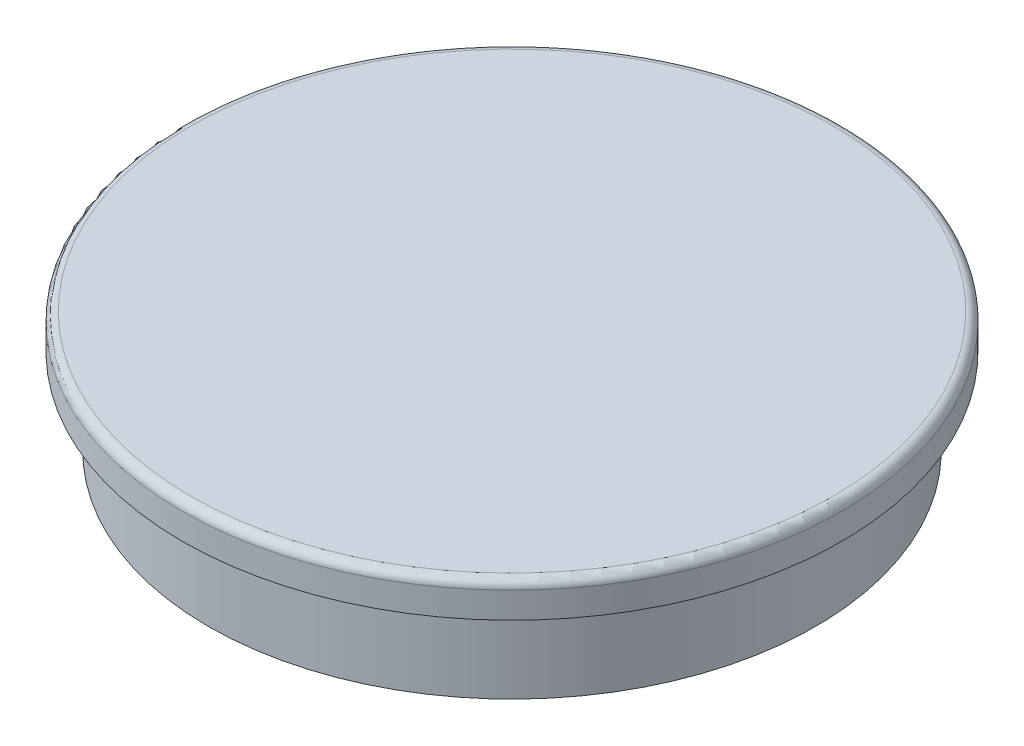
ISO-10303-21;
HEADER;
FILE_DESCRIPTION(('STEP AP214'),'2;1');
FILE_NAME('part.step','',(''),(''),'','','');
FILE_SCHEMA(('AUTOMOTIVE_DESIGN { 1 0 10303 214 1 1 1 1 }'));
ENDSEC;
DATA;
#1=APPLICATION_CONTEXT('core data for automotive mechanical design processes');
#2=APPLICATION_PROTOCOL_DEFINITION('international standard','automotive_design',2000,#1);
#3=PRODUCT_CONTEXT('',#1,'mechanical');
#4=PRODUCT('Part','Part','',(#3));
#5=PRODUCT_RELATED_PRODUCT_CATEGORY('part','',(#4));
#6=PRODUCT_DEFINITION_FORMATION('','',#4);
#7=PRODUCT_DEFINITION_CONTEXT('part definition',#1,'design');
#8=PRODUCT_DEFINITION('design','',#6,#7);
#9=PRODUCT_DEFINITION_SHAPE('','',#8);
#10=(LENGTH_UNIT() NAMED_UNIT(*) SI_UNIT(.MILLI.,.METRE.));
#11=(NAMED_UNIT(*) PLANE_ANGLE_UNIT() SI_UNIT($,.RADIAN.));
#12=(NAMED_UNIT(*) SI_UNIT($,.STERADIAN.) SOLID_ANGLE_UNIT());
#13=UNCERTAINTY_MEASURE_WITH_UNIT(LENGTH_MEASURE(1.E-05),#10,'distance_accuracy_value','');
#14=(GEOMETRIC_REPRESENTATION_CONTEXT(3) GLOBAL_UNCERTAINTY_ASSIGNED_CONTEXT((#13)) GLOBAL_UNIT_ASSIGNED_CONTEXT((#10,
#11,#12)) REPRESENTATION_CONTEXT('',''));
#15=CARTESIAN_POINT('',(0.,0.,0.));
#16=DIRECTION('',(0.,0.,1.));
#17=DIRECTION('',(1.,0.,0.));
#18=AXIS2_PLACEMENT_3D('',#15,#16,#17);
#19=CARTESIAN_POINT('',(0.,5.,0.));
#20=DIRECTION('',(0.,-1.,0.));
#21=DIRECTION('',(0.,0.,-1.));
#22=AXIS2_PLACEMENT_3D('',#19,#20,#21);
#23=CYLINDRICAL_SURFACE('',#22,17.5);
#24=CARTESIAN_POINT('',(0.,5.,0.));
#25=DIRECTION('',(0.,1.,0.));
#26=DIRECTION('',(0.,0.,1.));
#27=AXIS2_PLACEMENT_3D('',#24,#25,#26);
#28=CIRCLE('',#27,17.5);
#29=CARTESIAN_POINT('',(0.,5.,17.5));
#30=VERTEX_POINT('',#29);
#31=EDGE_CURVE('E44',#30,#30,#28,.T.);
#32=ORIENTED_EDGE('',*,*,#31,.F.);
#33=EDGE_LOOP('',(#32));
#34=FACE_BOUND('',#33,.T.);
#35=CARTESIAN_POINT('',(0.,0.,0.));
#36=DIRECTION('',(0.,1.,0.));
#37=DIRECTION('',(0.,0.,1.));
#38=AXIS2_PLACEMENT_3D('',#35,#36,#37);
#39=CIRCLE('',#38,17.5);
#40=CARTESIAN_POINT('',(0.,0.,17.5));
#41=VERTEX_POINT('',#40);
#42=EDGE_CURVE('E48',#41,#41,#39,.T.);
#43=ORIENTED_EDGE('',*,*,#42,.T.);
#44=EDGE_LOOP('',(#43));
#45=FACE_BOUND('',#44,.T.);
#46=ADVANCED_FACE('F33',(#34,#45),#23,.T.);
#47=CARTESIAN_POINT('',(0.,0.,0.));
#48=DIRECTION('',(0.,1.,0.));
#49=DIRECTION('',(0.,0.,1.));
#50=AXIS2_PLACEMENT_3D('',#47,#48,#49);
#51=PLANE('',#50);
#52=ORIENTED_EDGE('',*,*,#42,.F.);
#53=EDGE_LOOP('',(#52));
#54=FACE_BOUND('',#53,.T.);
#55=ADVANCED_FACE('F72',(#54),#51,.F.);
#56=CARTESIAN_POINT('',(0.,7.,0.));
#57=DIRECTION('',(0.,-1.,0.));
#58=DIRECTION('',(0.,0.,-1.));
#59=AXIS2_PLACEMENT_3D('',#56,#57,#58);
#60=CYLINDRICAL_SURFACE('',#59,19.);
#61=CARTESIAN_POINT('',(0.,6.5,0.));
#62=DIRECTION('',(0.,1.,0.));
#63=DIRECTION('',(0.,0.,1.));
#64=AXIS2_PLACEMENT_3D('',#61,#62,#63);
#65=CIRCLE('',#64,19.);
#66=CARTESIAN_POINT('',(0.,6.5,19.));
#67=VERTEX_POINT('',#66);
#68=EDGE_CURVE('E10',#67,#67,#65,.F.);
#69=ORIENTED_EDGE('',*,*,#68,.T.);
#70=EDGE_LOOP('',(#69));
#71=FACE_BOUND('',#70,.T.);
#72=CARTESIAN_POINT('',(0.,5.,0.));
#73=DIRECTION('',(0.,1.,0.));
#74=DIRECTION('',(0.,0.,1.));
#75=AXIS2_PLACEMENT_3D('',#72,#73,#74);
#76=CIRCLE('',#75,19.);
#77=CARTESIAN_POINT('',(0.,5.,19.));
#78=VERTEX_POINT('',#77);
#79=EDGE_CURVE('E52',#78,#78,#76,.T.);
#80=ORIENTED_EDGE('',*,*,#79,.T.);
#81=EDGE_LOOP('',(#80));
#82=FACE_BOUND('',#81,.T.);
#83=ADVANCED_FACE('F57',(#71,#82),#60,.T.);
#84=CARTESIAN_POINT('',(0.,7.,0.));
#85=DIRECTION('',(0.,1.,0.));
#86=DIRECTION('',(0.,0.,1.));
#87=AXIS2_PLACEMENT_3D('',#84,#85,#86);
#88=PLANE('',#87);
#89=CARTESIAN_POINT('',(0.,7.,0.));
#90=DIRECTION('',(0.,1.,0.));
#91=DIRECTION('',(0.,0.,1.));
#92=AXIS2_PLACEMENT_3D('',#89,#90,#91);
#93=CIRCLE('',#92,18.5);
#94=CARTESIAN_POINT('',(0.,7.,18.5));
#95=VERTEX_POINT('',#94);
#96=EDGE_CURVE('E40',#95,#95,#93,.T.);
#97=ORIENTED_EDGE('',*,*,#96,.T.);
#98=EDGE_LOOP('',(#97));
#99=FACE_BOUND('',#98,.T.);
#100=ADVANCED_FACE('F61',(#99),#88,.T.);
#101=CARTESIAN_POINT('',(0.,5.,0.));
#102=DIRECTION('',(0.,1.,0.));
#103=DIRECTION('',(0.,0.,1.));
#104=AXIS2_PLACEMENT_3D('',#101,#102,#103);
#105=PLANE('',#104);
#106=ORIENTED_EDGE('',*,*,#31,.T.);
#107=EDGE_LOOP('',(#106));
#108=FACE_BOUND('',#107,.T.);
#109=ORIENTED_EDGE('',*,*,#79,.F.);
#110=EDGE_LOOP('',(#109));
#111=FACE_BOUND('',#110,.T.);
#112=ADVANCED_FACE('F59',(#108,#111),#105,.F.);
#113=CARTESIAN_POINT('',(0.,6.5,0.));
#114=DIRECTION('',(0.,1.,0.));
#115=DIRECTION('',(0.,0.,1.));
#116=AXIS2_PLACEMENT_3D('',#113,#114,#115);
#117=TOROIDAL_SURFACE('',#116,18.5,0.5);
#118=ORIENTED_EDGE('',*,*,#68,.F.);
#119=EDGE_LOOP('',(#118));
#120=FACE_BOUND('',#119,.T.);
#121=ORIENTED_EDGE('',*,*,#96,.F.);
#122=EDGE_LOOP('',(#121));
#123=FACE_BOUND('',#122,.T.);
#124=ADVANCED_FACE('F35',(#120,#123),#117,.T.);
#125=CLOSED_SHELL('',(#46,#55,#83,#100,#112,#124));
#126=MANIFOLD_SOLID_BREP('B2',#125);
#127=ADVANCED_BREP_SHAPE_REPRESENTATION('',(#18,#126),#14);
#128=SHAPE_DEFINITION_REPRESENTATION(#9,#127);
ENDSEC;
END-ISO-10303-21;
